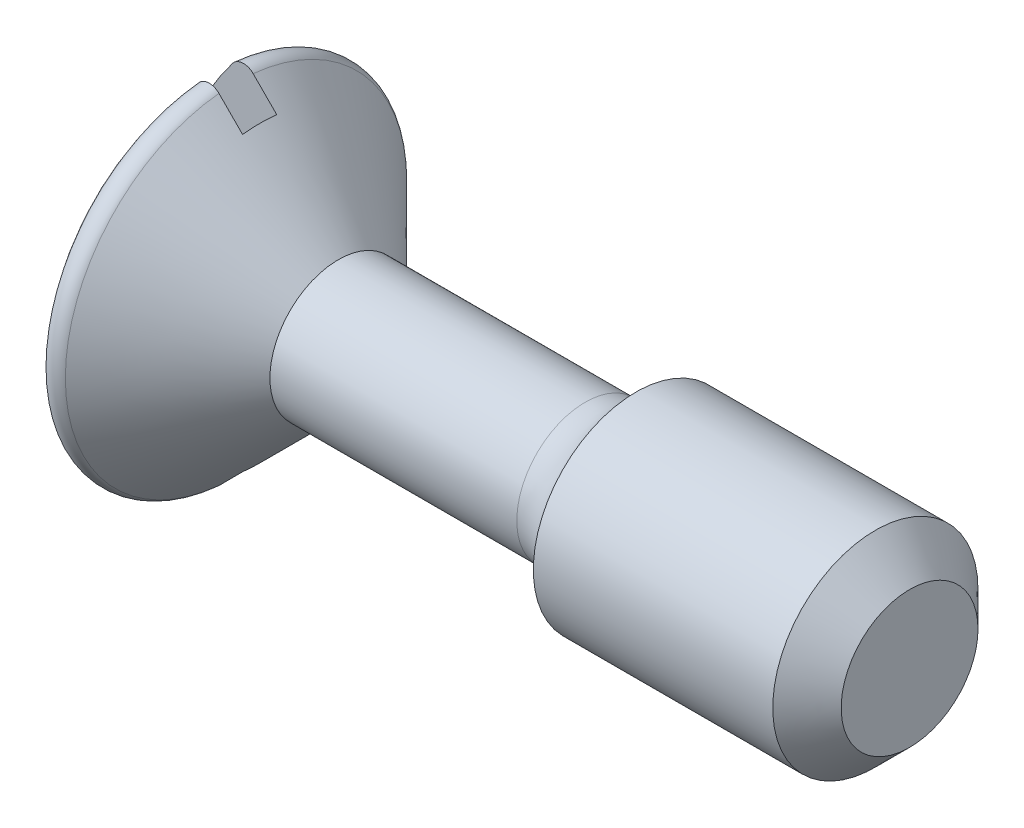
ISO-10303-21;
HEADER;
FILE_DESCRIPTION(('STEP AP214'),'2;1');
FILE_NAME('part.step','',(''),(''),'','','');
FILE_SCHEMA(('AUTOMOTIVE_DESIGN { 1 0 10303 214 1 1 1 1 }'));
ENDSEC;
DATA;
#1=APPLICATION_CONTEXT('core data for automotive mechanical design processes');
#2=APPLICATION_PROTOCOL_DEFINITION('international standard','automotive_design',2000,#1);
#3=PRODUCT_CONTEXT('',#1,'mechanical');
#4=PRODUCT('Part','Part','',(#3));
#5=PRODUCT_RELATED_PRODUCT_CATEGORY('part','',(#4));
#6=PRODUCT_DEFINITION_FORMATION('','',#4);
#7=PRODUCT_DEFINITION_CONTEXT('part definition',#1,'design');
#8=PRODUCT_DEFINITION('design','',#6,#7);
#9=PRODUCT_DEFINITION_SHAPE('','',#8);
#10=(LENGTH_UNIT() NAMED_UNIT(*) SI_UNIT(.MILLI.,.METRE.));
#11=(NAMED_UNIT(*) PLANE_ANGLE_UNIT() SI_UNIT($,.RADIAN.));
#12=(NAMED_UNIT(*) SI_UNIT($,.STERADIAN.) SOLID_ANGLE_UNIT());
#13=UNCERTAINTY_MEASURE_WITH_UNIT(LENGTH_MEASURE(1.E-05),#10,'distance_accuracy_value','');
#14=(GEOMETRIC_REPRESENTATION_CONTEXT(3) GLOBAL_UNCERTAINTY_ASSIGNED_CONTEXT((#13)) GLOBAL_UNIT_ASSIGNED_CONTEXT((#10,
#11,#12)) REPRESENTATION_CONTEXT('',''));
#15=CARTESIAN_POINT('',(0.,0.,0.));
#16=DIRECTION('',(0.,0.,1.));
#17=DIRECTION('',(1.,0.,0.));
#18=AXIS2_PLACEMENT_3D('',#15,#16,#17);
#19=CARTESIAN_POINT('',(9.99999999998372,0.,0.));
#20=DIRECTION('',(-1.,0.,0.));
#21=DIRECTION('',(0.,0.,1.));
#22=AXIS2_PLACEMENT_3D('',#19,#20,#21);
#23=CYLINDRICAL_SURFACE('',#22,1.);
#24=CARTESIAN_POINT('',(5.25838015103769,0.,0.));
#25=DIRECTION('',(1.,0.,0.));
#26=DIRECTION('',(0.,0.,-1.));
#27=AXIS2_PLACEMENT_3D('',#24,#25,#26);
#28=CIRCLE('',#27,1.);
#29=CARTESIAN_POINT('',(5.25838015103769,0.,-1.));
#30=VERTEX_POINT('',#29);
#31=EDGE_CURVE('E196',#30,#30,#28,.F.);
#32=ORIENTED_EDGE('',*,*,#31,.T.);
#33=EDGE_LOOP('',(#32));
#34=FACE_BOUND('',#33,.T.);
#35=CARTESIAN_POINT('',(1.65,0.,0.));
#36=DIRECTION('',(1.,0.,0.));
#37=DIRECTION('',(0.,0.,-1.));
#38=AXIS2_PLACEMENT_3D('',#35,#36,#37);
#39=CIRCLE('',#38,1.);
#40=CARTESIAN_POINT('',(1.65,0.,-1.));
#41=VERTEX_POINT('',#40);
#42=EDGE_CURVE('E207',#41,#41,#39,.T.);
#43=ORIENTED_EDGE('',*,*,#42,.T.);
#44=EDGE_LOOP('',(#43));
#45=FACE_BOUND('',#44,.T.);
#46=ADVANCED_FACE('F35',(#34,#45),#23,.T.);
#47=CARTESIAN_POINT('',(3.01125000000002,0.,0.));
#48=DIRECTION('',(0.,0.,1.));
#49=DIRECTION('',(1.,0.,0.));
#50=AXIS2_PLACEMENT_3D('',#47,#48,#49);
#51=SPHERICAL_SURFACE('',#50,4.01125000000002);
#52=CARTESIAN_POINT('',(3.01125000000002,0.,-0.25));
#53=DIRECTION('',(0.,0.,-1.));
#54=DIRECTION('',(-1.,0.,0.));
#55=AXIS2_PLACEMENT_3D('',#52,#53,#54);
#56=CIRCLE('',#55,4.00345183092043);
#57=CARTESIAN_POINT('',(-0.143753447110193,-2.464463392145,-0.25));
#58=VERTEX_POINT('',#57);
#59=CARTESIAN_POINT('',(-0.143753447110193,2.464463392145,-0.25));
#60=VERTEX_POINT('',#59);
#61=EDGE_CURVE('E98',#58,#60,#56,.T.);
#62=ORIENTED_EDGE('',*,*,#61,.T.);
#63=CARTESIAN_POINT('',(-0.143753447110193,0.,0.));
#64=DIRECTION('',(1.,0.,0.));
#65=DIRECTION('',(0.,0.,-1.));
#66=AXIS2_PLACEMENT_3D('',#63,#64,#65);
#67=CIRCLE('',#66,2.47711118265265);
#68=EDGE_CURVE('E11',#60,#58,#67,.F.);
#69=ORIENTED_EDGE('',*,*,#68,.T.);
#70=EDGE_LOOP('',(#62,#69));
#71=FACE_BOUND('',#70,.T.);
#72=ADVANCED_FACE('F170',(#71),#51,.T.);
#73=CARTESIAN_POINT('',(1.65,0.,0.));
#74=DIRECTION('',(-1.,0.,0.));
#75=DIRECTION('',(0.,0.,-1.));
#76=AXIS2_PLACEMENT_3D('',#73,#74,#75);
#77=CONICAL_SURFACE('',#76,1.,0.78539816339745);
#78=CARTESIAN_POINT('',(-3.19431959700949,5.83897007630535,0.250000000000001));
#79=CARTESIAN_POINT('',(-2.9925484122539,5.63701255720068,0.250000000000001));
#80=CARTESIAN_POINT('',(-2.79078541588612,5.43504685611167,0.250000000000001));
#81=CARTESIAN_POINT('',(-2.38728568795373,5.03108777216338,0.250000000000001));
#82=CARTESIAN_POINT('',(-2.18554895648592,4.82909438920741,0.250000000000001));
#83=CARTESIAN_POINT('',(-1.78209774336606,4.42505469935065,0.250000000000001));
#84=CARTESIAN_POINT('',(-1.5803832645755,4.22300838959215,0.250000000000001));
#85=CARTESIAN_POINT('',(-1.17701269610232,3.81885891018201,0.25));
#86=CARTESIAN_POINT('',(-0.975356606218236,3.61675574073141,0.25));
#87=CARTESIAN_POINT('',(-0.572415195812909,3.21273755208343,0.25));
#88=CARTESIAN_POINT('',(-0.371129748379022,3.01082265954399,0.25));
#89=CARTESIAN_POINT('',(0.0312756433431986,2.60682402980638,0.25));
#90=CARTESIAN_POINT('',(0.232395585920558,2.40474029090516,0.25));
#91=CARTESIAN_POINT('',(0.634311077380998,2.00026706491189,0.25));
#92=CARTESIAN_POINT('',(0.835106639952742,1.79787759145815,0.25));
#93=CARTESIAN_POINT('',(1.13564700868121,1.49365156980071,0.25));
#94=CARTESIAN_POINT('',(1.2357174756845,1.39213677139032,0.25));
#95=CARTESIAN_POINT('',(1.43545086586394,1.18870725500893,0.25));
#96=CARTESIAN_POINT('',(1.5351137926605,1.08679254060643,0.25));
#97=CARTESIAN_POINT('',(1.6614682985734,0.956420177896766,0.25));
#98=CARTESIAN_POINT('',(1.68858376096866,0.928373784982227,0.25));
#99=CARTESIAN_POINT('',(1.74271923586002,0.872189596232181,0.25));
#100=CARTESIAN_POINT('',(1.7697392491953,0.844051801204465,0.25));
#101=CARTESIAN_POINT('',(1.85064043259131,0.759444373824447,0.25));
#102=CARTESIAN_POINT('',(1.90434197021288,0.702802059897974,0.25));
#103=CARTESIAN_POINT('',(1.99321764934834,0.607497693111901,0.25));
#104=CARTESIAN_POINT('',(2.02865077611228,0.569078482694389,0.25));
#105=CARTESIAN_POINT('',(2.08122108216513,0.510956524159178,0.25));
#106=CARTESIAN_POINT('',(2.09864022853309,0.491509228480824,0.25));
#107=CARTESIAN_POINT('',(2.13322258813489,0.452374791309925,0.25));
#108=CARTESIAN_POINT('',(2.15038570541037,0.432687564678,0.25));
#109=CARTESIAN_POINT('',(2.19098847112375,0.385224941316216,0.25));
#110=CARTESIAN_POINT('',(2.21425447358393,0.357300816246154,0.25));
#111=CARTESIAN_POINT('',(2.25952453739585,0.300453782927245,0.25));
#112=CARTESIAN_POINT('',(2.28152963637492,0.271531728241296,0.25));
#113=CARTESIAN_POINT('',(2.31841483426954,0.218468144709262,0.25));
#114=CARTESIAN_POINT('',(2.33379613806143,0.194678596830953,0.25));
#115=CARTESIAN_POINT('',(2.36152808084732,0.145369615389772,0.25));
#116=CARTESIAN_POINT('',(2.37389137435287,0.119857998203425,0.25));
#117=CARTESIAN_POINT('',(2.38836926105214,0.0783628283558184,0.25));
#118=CARTESIAN_POINT('',(2.3925984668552,0.0631513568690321,0.25));
#119=CARTESIAN_POINT('',(2.39838048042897,0.0322553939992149,0.25));
#120=CARTESIAN_POINT('',(2.39994347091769,0.0165729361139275,0.25));
#121=CARTESIAN_POINT('',(2.40005362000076,-0.0148668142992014,0.25));
#122=CARTESIAN_POINT('',(2.39858853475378,-0.0306241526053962,0.25));
#123=CARTESIAN_POINT('',(2.39296444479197,-0.0616709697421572,0.25));
#124=CARTESIAN_POINT('',(2.38879654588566,-0.076958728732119,0.25));
#125=CARTESIAN_POINT('',(2.37808786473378,-0.108010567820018,0.25));
#126=CARTESIAN_POINT('',(2.37138508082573,-0.123716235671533,0.25));
#127=CARTESIAN_POINT('',(2.35646848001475,-0.154405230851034,0.25));
#128=CARTESIAN_POINT('',(2.34825171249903,-0.169387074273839,0.25));
#129=CARTESIAN_POINT('',(2.33076684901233,-0.198876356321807,0.25));
#130=CARTESIAN_POINT('',(2.32149084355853,-0.213379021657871,0.25));
#131=CARTESIAN_POINT('',(2.30227623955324,-0.24191314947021,0.25));
#132=CARTESIAN_POINT('',(2.29233826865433,-0.255945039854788,0.25));
#133=CARTESIAN_POINT('',(2.25986484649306,-0.300232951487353,0.25));
#134=CARTESIAN_POINT('',(2.23646143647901,-0.329847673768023,0.25));
#135=CARTESIAN_POINT('',(2.18856631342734,-0.388188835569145,0.25));
#136=CARTESIAN_POINT('',(2.16407394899,-0.416914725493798,0.25));
#137=CARTESIAN_POINT('',(2.11441429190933,-0.47386374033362,0.25));
#138=CARTESIAN_POINT('',(2.08924591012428,-0.50208591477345,0.25));
#139=CARTESIAN_POINT('',(2.03852163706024,-0.558163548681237,0.25));
#140=CARTESIAN_POINT('',(2.01296585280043,-0.586019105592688,0.25));
#141=CARTESIAN_POINT('',(1.93609490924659,-0.669031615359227,0.25));
#142=CARTESIAN_POINT('',(1.88439780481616,-0.72383431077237,0.25));
#143=CARTESIAN_POINT('',(1.7805451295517,-0.832896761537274,0.25));
#144=CARTESIAN_POINT('',(1.72839006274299,-0.887157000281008,0.25));
#145=CARTESIAN_POINT('',(1.57190285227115,-1.04908694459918,0.25));
#146=CARTESIAN_POINT('',(1.46713894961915,-1.15633908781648,0.25));
#147=CARTESIAN_POINT('',(1.25714145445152,-1.37038437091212,0.25));
#148=CARTESIAN_POINT('',(1.15190785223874,-1.47717750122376,0.25));
#149=CARTESIAN_POINT('',(0.941142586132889,-1.69055441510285,0.25));
#150=CARTESIAN_POINT('',(0.835610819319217,-1.79713809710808,0.25));
#151=CARTESIAN_POINT('',(0.624401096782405,-2.01015864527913,0.25));
#152=CARTESIAN_POINT('',(0.518723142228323,-2.11659551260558,0.25));
#153=CARTESIAN_POINT('',(0.201476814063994,-2.43584587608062,0.25));
#154=CARTESIAN_POINT('',(-0.0102287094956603,-2.64852308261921,0.25));
#155=CARTESIAN_POINT('',(-0.433782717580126,-3.07368516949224,0.25));
#156=CARTESIAN_POINT('',(-0.645631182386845,-3.28617006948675,0.25));
#157=CARTESIAN_POINT('',(-1.0522029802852,-3.69377867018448,0.25));
#158=CARTESIAN_POINT('',(-1.24691881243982,-3.88890985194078,0.25));
#159=CARTESIAN_POINT('',(-1.63640898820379,-4.27912870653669,0.250000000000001));
#160=CARTESIAN_POINT('',(-1.83118333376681,-4.47421637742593,0.250000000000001));
#161=CARTESIAN_POINT('',(-2.22067472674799,-4.86426578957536,0.250000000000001));
#162=CARTESIAN_POINT('',(-2.4153917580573,-5.05922754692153,0.250000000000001));
#163=CARTESIAN_POINT('',(-2.80484316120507,-5.4491187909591,0.250000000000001));
#164=CARTESIAN_POINT('',(-2.99957753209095,-5.64404827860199,0.250000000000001));
#165=CARTESIAN_POINT('',(-3.19431959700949,-5.83897007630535,0.250000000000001));
#166=B_SPLINE_CURVE_WITH_KNOTS('',3,(#78,#79,#80,#81,#82,#83,#84,#85,#86,#87,#88,#89,#90,#91,
#92,#93,#94,#95,#96,#97,#98,#99,#100,#101,#102,#103,#104,#105,#106,#107,#108,#109,#110,#111,
#112,#113,#114,#115,#116,#117,#118,#119,#120,#121,#122,#123,#124,#125,#126,#127,#128,#129,#130,
#131,#132,#133,#134,#135,#136,#137,#138,#139,#140,#141,#142,#143,#144,#145,#146,#147,#148,#149,
#150,#151,#152,#153,#154,#155,#156,#157,#158,#159,#160,#161,#162,#163,#164,#165),.UNSPECIFIED.,
.F.,.F.,(4,2,2,2,2,2,2,2,2,2,2,2,2,2,2,2,2,2,2,2,2,2,2,2,2,2,2,2,2,2,2,2,2,2,2,2,2,2,2,2,2,2,2,
4),(0.,0.856438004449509,1.71287908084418,2.56938533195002,3.42588859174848,4.28120659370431,
5.13653332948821,5.99182297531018,6.41946070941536,6.84709463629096,6.96412703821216,
7.08115840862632,7.31531054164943,7.47209628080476,7.5504185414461,7.62876945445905,
7.73779779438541,7.84673508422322,7.93165321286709,8.01620891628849,8.06339467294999,
8.11039981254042,8.15759538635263,8.20494706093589,8.25605487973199,8.30726337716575,
8.35888291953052,8.41045419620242,8.5236270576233,8.63686855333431,8.75030496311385,
8.86371058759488,9.089718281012,9.31550243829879,9.76528198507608,10.215070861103,
10.6650407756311,11.115007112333,12.0152608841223,12.9154088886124,13.742399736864,
14.5694222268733,15.3960559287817,16.2226578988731),.UNSPECIFIED.);
#167=CARTESIAN_POINT('',(0.154975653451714,2.48246782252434,0.25));
#168=VERTEX_POINT('',#167);
#169=CARTESIAN_POINT('',(0.5,2.13541565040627,0.25));
#170=VERTEX_POINT('',#169);
#171=EDGE_CURVE('E105',#168,#170,#166,.T.);
#172=ORIENTED_EDGE('',*,*,#171,.F.);
#173=CARTESIAN_POINT('',(0.154975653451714,0.,0.));
#174=DIRECTION('',(-1.,0.,0.));
#175=DIRECTION('',(0.,0.,1.));
#176=AXIS2_PLACEMENT_3D('',#173,#174,#175);
#177=CIRCLE('',#176,2.49502434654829);
#178=CARTESIAN_POINT('',(0.154975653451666,-2.48246782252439,0.25));
#179=VERTEX_POINT('',#178);
#180=EDGE_CURVE('E112',#168,#179,#177,.F.);
#181=ORIENTED_EDGE('',*,*,#180,.T.);
#182=CARTESIAN_POINT('',(0.5,-2.13541565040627,0.25));
#183=VERTEX_POINT('',#182);
#184=EDGE_CURVE('E103',#183,#179,#166,.T.);
#185=ORIENTED_EDGE('',*,*,#184,.F.);
#186=CARTESIAN_POINT('',(0.5,0.,0.));
#187=DIRECTION('',(1.,0.,0.));
#188=DIRECTION('',(0.,0.,-1.));
#189=AXIS2_PLACEMENT_3D('',#186,#187,#188);
#190=CIRCLE('',#189,2.15);
#191=CARTESIAN_POINT('',(0.5,-2.13541565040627,-0.25));
#192=VERTEX_POINT('',#191);
#193=EDGE_CURVE('E87',#192,#183,#190,.F.);
#194=ORIENTED_EDGE('',*,*,#193,.F.);
#195=CARTESIAN_POINT('',(-3.19431959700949,-5.83897007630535,-0.25));
#196=CARTESIAN_POINT('',(-2.9925484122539,-5.63701255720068,-0.25));
#197=CARTESIAN_POINT('',(-2.79078541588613,-5.43504685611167,-0.25));
#198=CARTESIAN_POINT('',(-2.38728568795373,-5.03108777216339,-0.25));
#199=CARTESIAN_POINT('',(-2.18554895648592,-4.82909438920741,-0.25));
#200=CARTESIAN_POINT('',(-1.78209774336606,-4.42505469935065,-0.25));
#201=CARTESIAN_POINT('',(-1.5803832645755,-4.22300838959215,-0.25));
#202=CARTESIAN_POINT('',(-1.17701269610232,-3.81885891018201,-0.25));
#203=CARTESIAN_POINT('',(-0.975356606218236,-3.61675574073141,-0.25));
#204=CARTESIAN_POINT('',(-0.572415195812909,-3.21273755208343,-0.25));
#205=CARTESIAN_POINT('',(-0.371129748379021,-3.01082265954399,-0.25));
#206=CARTESIAN_POINT('',(0.0312756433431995,-2.60682402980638,-0.25));
#207=CARTESIAN_POINT('',(0.232395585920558,-2.40474029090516,-0.25));
#208=CARTESIAN_POINT('',(0.634311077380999,-2.00026706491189,-0.25));
#209=CARTESIAN_POINT('',(0.835106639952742,-1.79787759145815,-0.25));
#210=CARTESIAN_POINT('',(1.13564700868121,-1.49365156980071,-0.25));
#211=CARTESIAN_POINT('',(1.2357174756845,-1.39213677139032,-0.25));
#212=CARTESIAN_POINT('',(1.43545086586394,-1.18870725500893,-0.25));
#213=CARTESIAN_POINT('',(1.5351137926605,-1.08679254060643,-0.25));
#214=CARTESIAN_POINT('',(1.6614682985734,-0.956420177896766,-0.25));
#215=CARTESIAN_POINT('',(1.68858376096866,-0.928373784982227,-0.25));
#216=CARTESIAN_POINT('',(1.74271923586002,-0.872189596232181,-0.25));
#217=CARTESIAN_POINT('',(1.7697392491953,-0.844051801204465,-0.25));
#218=CARTESIAN_POINT('',(1.85064043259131,-0.759444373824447,-0.25));
#219=CARTESIAN_POINT('',(1.90434197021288,-0.702802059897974,-0.25));
#220=CARTESIAN_POINT('',(1.99321764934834,-0.607497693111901,-0.25));
#221=CARTESIAN_POINT('',(2.02865077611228,-0.569078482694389,-0.25));
#222=CARTESIAN_POINT('',(2.08122108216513,-0.510956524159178,-0.25));
#223=CARTESIAN_POINT('',(2.09864022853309,-0.491509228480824,-0.25));
#224=CARTESIAN_POINT('',(2.13322258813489,-0.452374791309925,-0.25));
#225=CARTESIAN_POINT('',(2.15038570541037,-0.432687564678,-0.25));
#226=CARTESIAN_POINT('',(2.19098847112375,-0.385224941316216,-0.25));
#227=CARTESIAN_POINT('',(2.21425447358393,-0.357300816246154,-0.25));
#228=CARTESIAN_POINT('',(2.25952453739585,-0.300453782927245,-0.25));
#229=CARTESIAN_POINT('',(2.28152963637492,-0.271531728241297,-0.25));
#230=CARTESIAN_POINT('',(2.31841483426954,-0.218468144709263,-0.25));
#231=CARTESIAN_POINT('',(2.33379613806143,-0.194678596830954,-0.25));
#232=CARTESIAN_POINT('',(2.36152808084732,-0.145369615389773,-0.25));
#233=CARTESIAN_POINT('',(2.37389137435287,-0.119857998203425,-0.25));
#234=CARTESIAN_POINT('',(2.38836926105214,-0.0783628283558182,-0.25));
#235=CARTESIAN_POINT('',(2.3925984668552,-0.063151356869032,-0.25));
#236=CARTESIAN_POINT('',(2.39838048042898,-0.0322553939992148,-0.25));
#237=CARTESIAN_POINT('',(2.39994347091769,-0.0165729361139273,-0.25));
#238=CARTESIAN_POINT('',(2.40005362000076,0.0148668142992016,-0.25));
#239=CARTESIAN_POINT('',(2.39858853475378,0.0306241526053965,-0.25));
#240=CARTESIAN_POINT('',(2.39296444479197,0.0616709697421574,-0.25));
#241=CARTESIAN_POINT('',(2.38879654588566,0.0769587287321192,-0.25));
#242=CARTESIAN_POINT('',(2.37808786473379,0.108010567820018,-0.25));
#243=CARTESIAN_POINT('',(2.37138508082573,0.123716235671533,-0.25));
#244=CARTESIAN_POINT('',(2.35646848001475,0.154405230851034,-0.25));
#245=CARTESIAN_POINT('',(2.34825171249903,0.16938707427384,-0.25));
#246=CARTESIAN_POINT('',(2.33076684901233,0.198876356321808,-0.25));
#247=CARTESIAN_POINT('',(2.32149084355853,0.213379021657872,-0.25));
#248=CARTESIAN_POINT('',(2.30227623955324,0.241913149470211,-0.25));
#249=CARTESIAN_POINT('',(2.29233826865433,0.255945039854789,-0.25));
#250=CARTESIAN_POINT('',(2.25986484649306,0.300232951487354,-0.25));
#251=CARTESIAN_POINT('',(2.23646143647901,0.329847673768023,-0.25));
#252=CARTESIAN_POINT('',(2.18856631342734,0.388188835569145,-0.25));
#253=CARTESIAN_POINT('',(2.16407394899,0.416914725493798,-0.25));
#254=CARTESIAN_POINT('',(2.11441429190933,0.473863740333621,-0.25));
#255=CARTESIAN_POINT('',(2.08924591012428,0.502085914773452,-0.25));
#256=CARTESIAN_POINT('',(2.03852163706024,0.558163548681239,-0.25));
#257=CARTESIAN_POINT('',(2.01296585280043,0.58601910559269,-0.25));
#258=CARTESIAN_POINT('',(1.93609490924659,0.66903161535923,-0.25));
#259=CARTESIAN_POINT('',(1.88439780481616,0.723834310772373,-0.25));
#260=CARTESIAN_POINT('',(1.7805451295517,0.832896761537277,-0.25));
#261=CARTESIAN_POINT('',(1.72839006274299,0.887157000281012,-0.25));
#262=CARTESIAN_POINT('',(1.57190285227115,1.04908694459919,-0.25));
#263=CARTESIAN_POINT('',(1.46713894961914,1.15633908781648,-0.25));
#264=CARTESIAN_POINT('',(1.25714145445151,1.37038437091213,-0.25));
#265=CARTESIAN_POINT('',(1.15190785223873,1.47717750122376,-0.25));
#266=CARTESIAN_POINT('',(0.941142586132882,1.69055441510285,-0.25));
#267=CARTESIAN_POINT('',(0.835610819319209,1.79713809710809,-0.25));
#268=CARTESIAN_POINT('',(0.624401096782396,2.01015864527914,-0.25));
#269=CARTESIAN_POINT('',(0.518723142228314,2.11659551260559,-0.25));
#270=CARTESIAN_POINT('',(0.201476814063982,2.43584587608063,-0.25));
#271=CARTESIAN_POINT('',(-0.0102287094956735,2.64852308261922,-0.25));
#272=CARTESIAN_POINT('',(-0.433782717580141,3.07368516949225,-0.25));
#273=CARTESIAN_POINT('',(-0.645631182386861,3.28617006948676,-0.25));
#274=CARTESIAN_POINT('',(-1.05220298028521,3.69377867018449,-0.25));
#275=CARTESIAN_POINT('',(-1.24691881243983,3.88890985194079,-0.25));
#276=CARTESIAN_POINT('',(-1.6364089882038,4.2791287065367,-0.25));
#277=CARTESIAN_POINT('',(-1.83118333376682,4.47421637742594,-0.25));
#278=CARTESIAN_POINT('',(-2.220674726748,4.86426578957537,-0.25));
#279=CARTESIAN_POINT('',(-2.41539175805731,5.05922754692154,-0.25));
#280=CARTESIAN_POINT('',(-2.80484316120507,5.44911879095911,-0.25));
#281=CARTESIAN_POINT('',(-2.99957753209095,5.64404827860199,-0.25));
#282=CARTESIAN_POINT('',(-3.19431959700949,5.83897007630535,-0.25));
#283=B_SPLINE_CURVE_WITH_KNOTS('',3,(#195,#196,#197,#198,#199,#200,#201,#202,#203,#204,#205,
#206,#207,#208,#209,#210,#211,#212,#213,#214,#215,#216,#217,#218,#219,#220,#221,#222,#223,#224,
#225,#226,#227,#228,#229,#230,#231,#232,#233,#234,#235,#236,#237,#238,#239,#240,#241,#242,#243,
#244,#245,#246,#247,#248,#249,#250,#251,#252,#253,#254,#255,#256,#257,#258,#259,#260,#261,#262,
#263,#264,#265,#266,#267,#268,#269,#270,#271,#272,#273,#274,#275,#276,#277,#278,#279,#280,#281,
#282),.UNSPECIFIED.,.F.,.F.,(4,2,2,2,2,2,2,2,2,2,2,2,2,2,2,2,2,2,2,2,2,2,2,2,2,2,2,2,2,2,2,2,2,
2,2,2,2,2,2,2,2,2,2,4),(0.,0.856438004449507,1.71287908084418,2.56938533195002,3.42588859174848,
4.28120659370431,5.13653332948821,5.99182297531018,6.41946070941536,6.84709463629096,
6.96412703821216,7.08115840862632,7.31531054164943,7.47209628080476,7.5504185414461,
7.62876945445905,7.73779779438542,7.84673508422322,7.93165321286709,8.0162089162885,
8.06339467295,8.11039981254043,8.15759538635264,8.2049470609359,8.25605487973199,
8.30726337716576,8.35888291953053,8.41045419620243,8.5236270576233,8.63686855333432,
8.75030496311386,8.86371058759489,9.08971828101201,9.3155024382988,9.76528198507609,
10.215070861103,10.6650407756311,11.115007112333,12.0152608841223,12.9154088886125,
13.7423997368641,14.5694222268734,15.3960559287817,16.2226578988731),.UNSPECIFIED.);
#284=CARTESIAN_POINT('',(0.154975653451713,-2.48246782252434,-0.25));
#285=VERTEX_POINT('',#284);
#286=EDGE_CURVE('E204',#285,#192,#283,.T.);
#287=ORIENTED_EDGE('',*,*,#286,.F.);
#288=CARTESIAN_POINT('',(0.154975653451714,0.,0.));
#289=DIRECTION('',(-1.,0.,0.));
#290=DIRECTION('',(0.,0.,1.));
#291=AXIS2_PLACEMENT_3D('',#288,#289,#290);
#292=CIRCLE('',#291,2.49502434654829);
#293=CARTESIAN_POINT('',(0.154975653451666,2.48246782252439,-0.25));
#294=VERTEX_POINT('',#293);
#295=EDGE_CURVE('E200',#285,#294,#292,.F.);
#296=ORIENTED_EDGE('',*,*,#295,.T.);
#297=CARTESIAN_POINT('',(0.5,2.13541565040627,-0.25));
#298=VERTEX_POINT('',#297);
#299=EDGE_CURVE('E114',#298,#294,#283,.T.);
#300=ORIENTED_EDGE('',*,*,#299,.F.);
#301=EDGE_CURVE('E97',#170,#298,#190,.F.);
#302=ORIENTED_EDGE('',*,*,#301,.F.);
#303=EDGE_LOOP('',(#172,#181,#185,#194,#287,#296,#300,#302));
#304=FACE_BOUND('',#303,.T.);
#305=ORIENTED_EDGE('',*,*,#42,.F.);
#306=EDGE_LOOP('',(#305));
#307=FACE_BOUND('',#306,.T.);
#308=ADVANCED_FACE('F109',(#304,#307),#77,.T.);
#309=CARTESIAN_POINT('',(3.01125000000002,0.,0.25));
#310=DIRECTION('',(0.,0.,1.));
#311=DIRECTION('',(1.,0.,0.));
#312=AXIS2_PLACEMENT_3D('',#309,#310,#311);
#313=CIRCLE('',#312,4.00345183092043);
#314=CARTESIAN_POINT('',(-0.143753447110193,2.464463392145,0.25));
#315=VERTEX_POINT('',#314);
#316=CARTESIAN_POINT('',(-0.143753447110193,-2.464463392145,0.25));
#317=VERTEX_POINT('',#316);
#318=EDGE_CURVE('E209',#315,#317,#313,.T.);
#319=ORIENTED_EDGE('',*,*,#318,.T.);
#320=CARTESIAN_POINT('',(-0.143753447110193,0.,0.));
#321=DIRECTION('',(1.,0.,0.));
#322=DIRECTION('',(0.,0.,-1.));
#323=AXIS2_PLACEMENT_3D('',#320,#321,#322);
#324=CIRCLE('',#323,2.47711118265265);
#325=EDGE_CURVE('E213',#317,#315,#324,.F.);
#326=ORIENTED_EDGE('',*,*,#325,.T.);
#327=EDGE_LOOP('',(#319,#326));
#328=FACE_BOUND('',#327,.T.);
#329=ADVANCED_FACE('F167',(#328),#51,.T.);
#330=CARTESIAN_POINT('',(0.5,-2.65000000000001,-0.25));
#331=DIRECTION('',(0.,0.,-1.));
#332=DIRECTION('',(-1.,0.,0.));
#333=AXIS2_PLACEMENT_3D('',#330,#331,#332);
#334=PLANE('',#333);
#335=ORIENTED_EDGE('',*,*,#299,.T.);
#336=CARTESIAN_POINT('',(0.154975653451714,2.48246782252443,-0.249999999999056));
#337=CARTESIAN_POINT('',(0.147056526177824,2.49044075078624,-0.249999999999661));
#338=CARTESIAN_POINT('',(0.138455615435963,2.49773242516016,-0.249999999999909));
#339=CARTESIAN_POINT('',(0.120163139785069,2.51077268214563,-0.25000000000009));
#340=CARTESIAN_POINT('',(0.110472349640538,2.51652235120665,-0.250000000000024));
#341=CARTESIAN_POINT('',(0.0902552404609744,2.52631260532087,-0.249999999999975));
#342=CARTESIAN_POINT('',(0.079728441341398,2.53035219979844,-0.249999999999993));
#343=CARTESIAN_POINT('',(0.0581469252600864,2.53660143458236,-0.250000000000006));
#344=CARTESIAN_POINT('',(0.0470922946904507,2.53881137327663,-0.250000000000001));
#345=CARTESIAN_POINT('',(0.0247964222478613,2.5413338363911,-0.249999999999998));
#346=CARTESIAN_POINT('',(0.0135557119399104,2.54165105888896,-0.249999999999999));
#347=CARTESIAN_POINT('',(-0.00881885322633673,2.54039163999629,-0.25));
#348=CARTESIAN_POINT('',(-0.01995271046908,2.53881504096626,-0.25));
#349=CARTESIAN_POINT('',(-0.0417842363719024,2.53381675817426,-0.249999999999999));
#350=CARTESIAN_POINT('',(-0.0524824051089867,2.53039725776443,-0.25));
#351=CARTESIAN_POINT('',(-0.0731568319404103,2.52181385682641,-0.25));
#352=CARTESIAN_POINT('',(-0.0831329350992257,2.51664958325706,-0.25));
#353=CARTESIAN_POINT('',(-0.10237313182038,2.50453755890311,-0.25));
#354=CARTESIAN_POINT('',(-0.111605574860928,2.49753949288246,-0.25));
#355=CARTESIAN_POINT('',(-0.128744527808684,2.48205910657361,-0.25));
#356=CARTESIAN_POINT('',(-0.136649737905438,2.47357534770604,-0.25));
#357=CARTESIAN_POINT('',(-0.143753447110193,2.464463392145,-0.25));
#358=B_SPLINE_CURVE_WITH_KNOTS('',3,(#336,#337,#338,#339,#340,#341,#342,#343,#344,#345,#346,
#347,#348,#349,#350,#351,#352,#353,#354,#355,#356,#357),.UNSPECIFIED.,.F.,.F.,(4,2,2,2,2,2,2,2,
2,2,4),(0.,0.0336689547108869,0.0673141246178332,0.100978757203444,0.134637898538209,
0.168213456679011,0.201788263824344,0.235323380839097,0.268865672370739,0.30344755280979,
0.338063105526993),.UNSPECIFIED.);
#359=EDGE_CURVE('E44',#294,#60,#358,.T.);
#360=ORIENTED_EDGE('',*,*,#359,.T.);
#361=ORIENTED_EDGE('',*,*,#61,.F.);
#362=CARTESIAN_POINT('',(-0.143753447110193,-2.464463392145,-0.249999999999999));
#363=CARTESIAN_POINT('',(-0.136833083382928,-2.47333852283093,-0.25));
#364=CARTESIAN_POINT('',(-0.129153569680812,-2.48161814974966,-0.25));
#365=CARTESIAN_POINT('',(-0.112525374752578,-2.49677409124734,-0.25));
#366=CARTESIAN_POINT('',(-0.103577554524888,-2.50365135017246,-0.25));
#367=CARTESIAN_POINT('',(-0.0846462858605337,-2.51580638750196,-0.25));
#368=CARTESIAN_POINT('',(-0.0746622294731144,-2.52108321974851,-0.25));
#369=CARTESIAN_POINT('',(-0.0539498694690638,-2.52987944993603,-0.25));
#370=CARTESIAN_POINT('',(-0.0432216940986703,-2.53339914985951,-0.25));
#371=CARTESIAN_POINT('',(-0.021357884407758,-2.53857097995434,-0.25));
#372=CARTESIAN_POINT('',(-0.0102235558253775,-2.54022862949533,-0.25));
#373=CARTESIAN_POINT('',(0.0121650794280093,-2.54164686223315,-0.25));
#374=CARTESIAN_POINT('',(0.0234193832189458,-2.54140749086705,-0.25));
#375=CARTESIAN_POINT('',(0.0457028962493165,-2.53904109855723,-0.25));
#376=CARTESIAN_POINT('',(0.0567325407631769,-2.5369181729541,-0.25));
#377=CARTESIAN_POINT('',(0.0782816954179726,-2.53085244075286,-0.25));
#378=CARTESIAN_POINT('',(0.0888011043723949,-2.52690927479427,-0.25));
#379=CARTESIAN_POINT('',(0.109300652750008,-2.51718530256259,-0.25));
#380=CARTESIAN_POINT('',(0.119258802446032,-2.5113581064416,-0.25));
#381=CARTESIAN_POINT('',(0.138042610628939,-2.49808259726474,-0.25));
#382=CARTESIAN_POINT('',(0.146867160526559,-2.49063271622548,-0.25));
#383=CARTESIAN_POINT('',(0.154975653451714,-2.48246782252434,-0.25));
#384=B_SPLINE_CURVE_WITH_KNOTS('',3,(#362,#363,#364,#365,#366,#367,#368,#369,#370,#371,#372,
#373,#374,#375,#376,#377,#378,#379,#380,#381,#382,#383),.UNSPECIFIED.,.F.,.F.,(4,2,2,2,2,2,2,2,
2,2,4),(0.,0.0337196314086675,0.0674164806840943,0.101133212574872,0.134844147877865,
0.168454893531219,0.202064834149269,0.235601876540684,0.269145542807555,0.303587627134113,
0.338063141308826),.UNSPECIFIED.);
#385=EDGE_CURVE('E212',#58,#285,#384,.T.);
#386=ORIENTED_EDGE('',*,*,#385,.T.);
#387=ORIENTED_EDGE('',*,*,#286,.T.);
#388=DIRECTION('',(0.,1.,0.));
#389=VECTOR('',#388,1.);
#390=CARTESIAN_POINT('',(0.5,-2.65000000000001,-0.25));
#391=LINE('',#390,#389);
#392=EDGE_CURVE('E93',#192,#298,#391,.T.);
#393=ORIENTED_EDGE('',*,*,#392,.T.);
#394=EDGE_LOOP('',(#335,#360,#361,#386,#387,#393));
#395=FACE_BOUND('',#394,.T.);
#396=ADVANCED_FACE('F135',(#395),#334,.F.);
#397=CARTESIAN_POINT('',(0.5,-2.65000000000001,-0.25));
#398=DIRECTION('',(1.,0.,0.));
#399=DIRECTION('',(0.,0.,-1.));
#400=AXIS2_PLACEMENT_3D('',#397,#398,#399);
#401=PLANE('',#400);
#402=ORIENTED_EDGE('',*,*,#193,.T.);
#403=DIRECTION('',(0.,1.,0.));
#404=VECTOR('',#403,1.);
#405=CARTESIAN_POINT('',(0.5,-2.65000000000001,0.25));
#406=LINE('',#405,#404);
#407=EDGE_CURVE('E90',#183,#170,#406,.T.);
#408=ORIENTED_EDGE('',*,*,#407,.T.);
#409=ORIENTED_EDGE('',*,*,#301,.T.);
#410=ORIENTED_EDGE('',*,*,#392,.F.);
#411=EDGE_LOOP('',(#402,#408,#409,#410));
#412=FACE_BOUND('',#411,.T.);
#413=ADVANCED_FACE('F89',(#412),#401,.F.);
#414=CARTESIAN_POINT('',(0.5,-2.65000000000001,0.25));
#415=DIRECTION('',(0.,0.,1.));
#416=DIRECTION('',(1.,0.,0.));
#417=AXIS2_PLACEMENT_3D('',#414,#415,#416);
#418=PLANE('',#417);
#419=ORIENTED_EDGE('',*,*,#184,.T.);
#420=CARTESIAN_POINT('',(0.154975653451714,-2.48246782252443,0.249999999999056));
#421=CARTESIAN_POINT('',(0.147056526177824,-2.49044075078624,0.249999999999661));
#422=CARTESIAN_POINT('',(0.138455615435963,-2.49773242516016,0.249999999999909));
#423=CARTESIAN_POINT('',(0.120163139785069,-2.51077268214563,0.250000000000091));
#424=CARTESIAN_POINT('',(0.110472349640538,-2.51652235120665,0.250000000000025));
#425=CARTESIAN_POINT('',(0.0902552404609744,-2.52631260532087,0.249999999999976));
#426=CARTESIAN_POINT('',(0.0797284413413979,-2.53035219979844,0.249999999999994));
#427=CARTESIAN_POINT('',(0.0581469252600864,-2.53660143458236,0.250000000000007));
#428=CARTESIAN_POINT('',(0.0470922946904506,-2.53881137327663,0.250000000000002));
#429=CARTESIAN_POINT('',(0.0247964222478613,-2.5413338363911,0.249999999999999));
#430=CARTESIAN_POINT('',(0.0135557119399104,-2.54165105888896,0.25));
#431=CARTESIAN_POINT('',(-0.0088188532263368,-2.54039163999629,0.250000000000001));
#432=CARTESIAN_POINT('',(-0.0199527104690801,-2.53881504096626,0.25));
#433=CARTESIAN_POINT('',(-0.0417842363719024,-2.53381675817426,0.25));
#434=CARTESIAN_POINT('',(-0.0524824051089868,-2.53039725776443,0.25));
#435=CARTESIAN_POINT('',(-0.0731568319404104,-2.52181385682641,0.25));
#436=CARTESIAN_POINT('',(-0.0831329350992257,-2.51664958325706,0.25));
#437=CARTESIAN_POINT('',(-0.10237313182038,-2.50453755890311,0.25));
#438=CARTESIAN_POINT('',(-0.111605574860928,-2.49753949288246,0.25));
#439=CARTESIAN_POINT('',(-0.128744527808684,-2.48205910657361,0.25));
#440=CARTESIAN_POINT('',(-0.136649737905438,-2.47357534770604,0.25));
#441=CARTESIAN_POINT('',(-0.143753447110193,-2.464463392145,0.25));
#442=B_SPLINE_CURVE_WITH_KNOTS('',3,(#420,#421,#422,#423,#424,#425,#426,#427,#428,#429,#430,
#431,#432,#433,#434,#435,#436,#437,#438,#439,#440,#441),.UNSPECIFIED.,.F.,.F.,(4,2,2,2,2,2,2,2,
2,2,4),(0.,0.0336689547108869,0.0673141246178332,0.100978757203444,0.134637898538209,
0.168213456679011,0.201788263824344,0.235323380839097,0.268865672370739,0.30344755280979,
0.338063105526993),.UNSPECIFIED.);
#443=EDGE_CURVE('E147',#179,#317,#442,.T.);
#444=ORIENTED_EDGE('',*,*,#443,.T.);
#445=ORIENTED_EDGE('',*,*,#318,.F.);
#446=CARTESIAN_POINT('',(-0.143753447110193,2.464463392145,0.25));
#447=CARTESIAN_POINT('',(-0.136833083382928,2.47333852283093,0.25));
#448=CARTESIAN_POINT('',(-0.129153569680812,2.48161814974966,0.25));
#449=CARTESIAN_POINT('',(-0.112525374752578,2.49677409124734,0.25));
#450=CARTESIAN_POINT('',(-0.103577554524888,2.50365135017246,0.25));
#451=CARTESIAN_POINT('',(-0.0846462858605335,2.51580638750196,0.25));
#452=CARTESIAN_POINT('',(-0.0746622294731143,2.52108321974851,0.25));
#453=CARTESIAN_POINT('',(-0.0539498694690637,2.52987944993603,0.25));
#454=CARTESIAN_POINT('',(-0.0432216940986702,2.53339914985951,0.25));
#455=CARTESIAN_POINT('',(-0.0213578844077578,2.53857097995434,0.25));
#456=CARTESIAN_POINT('',(-0.0102235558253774,2.54022862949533,0.25));
#457=CARTESIAN_POINT('',(0.0121650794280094,2.54164686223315,0.25));
#458=CARTESIAN_POINT('',(0.0234193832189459,2.54140749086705,0.25));
#459=CARTESIAN_POINT('',(0.0457028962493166,2.53904109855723,0.25));
#460=CARTESIAN_POINT('',(0.056732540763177,2.5369181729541,0.25));
#461=CARTESIAN_POINT('',(0.0782816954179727,2.53085244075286,0.25));
#462=CARTESIAN_POINT('',(0.088801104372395,2.52690927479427,0.25));
#463=CARTESIAN_POINT('',(0.109300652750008,2.51718530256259,0.25));
#464=CARTESIAN_POINT('',(0.119258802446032,2.5113581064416,0.25));
#465=CARTESIAN_POINT('',(0.138042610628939,2.49808259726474,0.25));
#466=CARTESIAN_POINT('',(0.146867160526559,2.49063271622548,0.25));
#467=CARTESIAN_POINT('',(0.154975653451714,2.48246782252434,0.25));
#468=B_SPLINE_CURVE_WITH_KNOTS('',3,(#446,#447,#448,#449,#450,#451,#452,#453,#454,#455,#456,
#457,#458,#459,#460,#461,#462,#463,#464,#465,#466,#467),.UNSPECIFIED.,.F.,.F.,(4,2,2,2,2,2,2,2,
2,2,4),(0.,0.0337196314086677,0.0674164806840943,0.101133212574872,0.134844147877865,
0.168454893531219,0.202064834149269,0.235601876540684,0.269145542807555,0.303587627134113,
0.338063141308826),.UNSPECIFIED.);
#469=EDGE_CURVE('E142',#315,#168,#468,.T.);
#470=ORIENTED_EDGE('',*,*,#469,.T.);
#471=ORIENTED_EDGE('',*,*,#171,.T.);
#472=ORIENTED_EDGE('',*,*,#407,.F.);
#473=EDGE_LOOP('',(#419,#444,#445,#470,#471,#472));
#474=FACE_BOUND('',#473,.T.);
#475=ADVANCED_FACE('F102',(#474),#418,.F.);
#476=CARTESIAN_POINT('',(5.99999999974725,0.,0.));
#477=DIRECTION('',(1.,0.,0.));
#478=DIRECTION('',(0.,0.,-1.));
#479=AXIS2_PLACEMENT_3D('',#476,#477,#478);
#480=CYLINDRICAL_SURFACE('',#479,1.5);
#481=CARTESIAN_POINT('',(9.49999999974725,0.,0.));
#482=DIRECTION('',(1.,0.,0.));
#483=DIRECTION('',(0.,0.,-1.));
#484=AXIS2_PLACEMENT_3D('',#481,#482,#483);
#485=CIRCLE('',#484,1.5);
#486=CARTESIAN_POINT('',(9.49999999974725,0.,-1.5));
#487=VERTEX_POINT('',#486);
#488=EDGE_CURVE('E193',#487,#487,#485,.F.);
#489=ORIENTED_EDGE('',*,*,#488,.T.);
#490=EDGE_LOOP('',(#489));
#491=FACE_BOUND('',#490,.T.);
#492=CARTESIAN_POINT('',(5.99999999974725,0.,0.));
#493=DIRECTION('',(1.,0.,0.));
#494=DIRECTION('',(0.,0.,-1.));
#495=AXIS2_PLACEMENT_3D('',#492,#493,#494);
#496=CIRCLE('',#495,1.5);
#497=CARTESIAN_POINT('',(5.99999999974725,0.,-1.5));
#498=VERTEX_POINT('',#497);
#499=EDGE_CURVE('E106',#498,#498,#496,.T.);
#500=ORIENTED_EDGE('',*,*,#499,.T.);
#501=EDGE_LOOP('',(#500));
#502=FACE_BOUND('',#501,.T.);
#503=ADVANCED_FACE('F133',(#491,#502),#480,.T.);
#504=CARTESIAN_POINT('',(9.99999999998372,0.,0.));
#505=DIRECTION('',(1.,0.,0.));
#506=DIRECTION('',(0.,0.,-1.));
#507=AXIS2_PLACEMENT_3D('',#504,#505,#506);
#508=PLANE('',#507);
#509=CARTESIAN_POINT('',(9.99999999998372,0.,0.));
#510=DIRECTION('',(1.,0.,0.));
#511=DIRECTION('',(0.,0.,-1.));
#512=AXIS2_PLACEMENT_3D('',#509,#510,#511);
#513=CIRCLE('',#512,0.99999999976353);
#514=CARTESIAN_POINT('',(9.99999999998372,0.,-0.99999999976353));
#515=VERTEX_POINT('',#514);
#516=EDGE_CURVE('E191',#515,#515,#513,.T.);
#517=ORIENTED_EDGE('',*,*,#516,.T.);
#518=EDGE_LOOP('',(#517));
#519=FACE_BOUND('',#518,.T.);
#520=ADVANCED_FACE('F165',(#519),#508,.T.);
#521=CARTESIAN_POINT('',(9.99999999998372,0.,0.));
#522=DIRECTION('',(-1.,0.,0.));
#523=DIRECTION('',(0.,0.,1.));
#524=AXIS2_PLACEMENT_3D('',#521,#522,#523);
#525=CONICAL_SURFACE('',#524,0.99999999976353,0.785398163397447);
#526=ORIENTED_EDGE('',*,*,#488,.F.);
#527=EDGE_LOOP('',(#526));
#528=FACE_BOUND('',#527,.T.);
#529=ORIENTED_EDGE('',*,*,#516,.F.);
#530=EDGE_LOOP('',(#529));
#531=FACE_BOUND('',#530,.T.);
#532=ADVANCED_FACE('F162',(#528,#531),#525,.T.);
#533=CARTESIAN_POINT('',(5.25838015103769,0.,0.));
#534=DIRECTION('',(1.,0.,0.));
#535=DIRECTION('',(0.,0.,-1.));
#536=AXIS2_PLACEMENT_3D('',#533,#534,#535);
#537=TOROIDAL_SURFACE('',#536,1.8,0.8);
#538=ORIENTED_EDGE('',*,*,#31,.F.);
#539=EDGE_LOOP('',(#538));
#540=FACE_BOUND('',#539,.T.);
#541=ORIENTED_EDGE('',*,*,#499,.F.);
#542=EDGE_LOOP('',(#541));
#543=FACE_BOUND('',#542,.T.);
#544=ADVANCED_FACE('F157',(#540,#543),#537,.F.);
#545=CARTESIAN_POINT('',(0.013554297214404,0.,0.));
#546=DIRECTION('',(1.,0.,0.));
#547=DIRECTION('',(0.,0.,-1.));
#548=AXIS2_PLACEMENT_3D('',#545,#546,#547);
#549=TOROIDAL_SURFACE('',#548,2.35360299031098,0.2);
#550=ORIENTED_EDGE('',*,*,#469,.F.);
#551=ORIENTED_EDGE('',*,*,#325,.F.);
#552=ORIENTED_EDGE('',*,*,#443,.F.);
#553=ORIENTED_EDGE('',*,*,#180,.F.);
#554=EDGE_LOOP('',(#550,#551,#552,#553));
#555=FACE_BOUND('',#554,.T.);
#556=ADVANCED_FACE('F153',(#555),#549,.T.);
#557=CARTESIAN_POINT('',(0.013554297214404,0.,0.));
#558=DIRECTION('',(1.,0.,0.));
#559=DIRECTION('',(0.,0.,-1.));
#560=AXIS2_PLACEMENT_3D('',#557,#558,#559);
#561=TOROIDAL_SURFACE('',#560,2.35360299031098,0.2);
#562=ORIENTED_EDGE('',*,*,#385,.F.);
#563=ORIENTED_EDGE('',*,*,#68,.F.);
#564=ORIENTED_EDGE('',*,*,#359,.F.);
#565=ORIENTED_EDGE('',*,*,#295,.F.);
#566=EDGE_LOOP('',(#562,#563,#564,#565));
#567=FACE_BOUND('',#566,.T.);
#568=ADVANCED_FACE('F37',(#567),#561,.T.);
#569=CLOSED_SHELL('',(#46,#72,#308,#329,#396,#413,#475,#503,#520,#532,#544,#556,#568));
#570=MANIFOLD_SOLID_BREP('B2',#569);
#571=ADVANCED_BREP_SHAPE_REPRESENTATION('',(#18,#570),#14);
#572=SHAPE_DEFINITION_REPRESENTATION(#9,#571);
ENDSEC;
END-ISO-10303-21;
